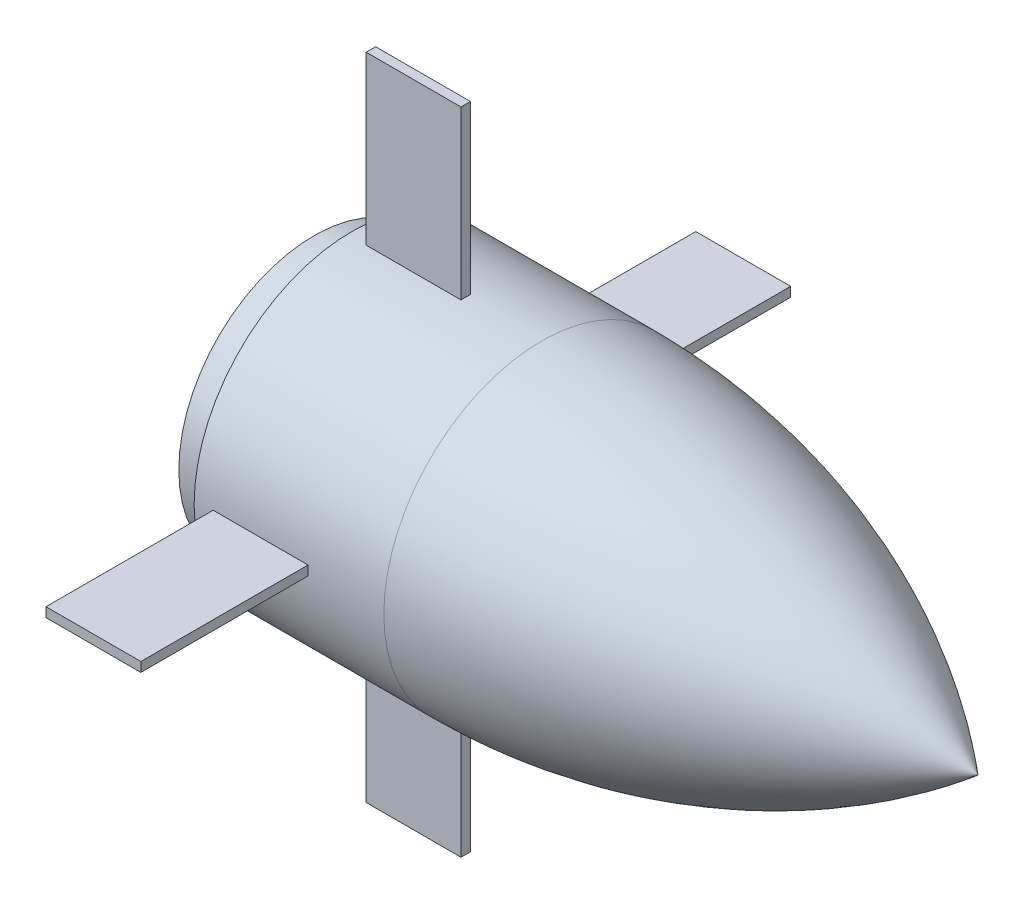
ISO-10303-21;
HEADER;
FILE_DESCRIPTION(('STEP AP214'),'2;1');
FILE_NAME('part.step','',(''),(''),'','','');
FILE_SCHEMA(('AUTOMOTIVE_DESIGN { 1 0 10303 214 1 1 1 1 }'));
ENDSEC;
DATA;
#1=APPLICATION_CONTEXT('core data for automotive mechanical design processes');
#2=APPLICATION_PROTOCOL_DEFINITION('international standard','automotive_design',2000,#1);
#3=PRODUCT_CONTEXT('',#1,'mechanical');
#4=PRODUCT('Part','Part','',(#3));
#5=PRODUCT_RELATED_PRODUCT_CATEGORY('part','',(#4));
#6=PRODUCT_DEFINITION_FORMATION('','',#4);
#7=PRODUCT_DEFINITION_CONTEXT('part definition',#1,'design');
#8=PRODUCT_DEFINITION('design','',#6,#7);
#9=PRODUCT_DEFINITION_SHAPE('','',#8);
#10=(LENGTH_UNIT() NAMED_UNIT(*) SI_UNIT(.MILLI.,.METRE.));
#11=(NAMED_UNIT(*) PLANE_ANGLE_UNIT() SI_UNIT($,.RADIAN.));
#12=(NAMED_UNIT(*) SI_UNIT($,.STERADIAN.) SOLID_ANGLE_UNIT());
#13=UNCERTAINTY_MEASURE_WITH_UNIT(LENGTH_MEASURE(1.E-05),#10,'distance_accuracy_value','');
#14=(GEOMETRIC_REPRESENTATION_CONTEXT(3) GLOBAL_UNCERTAINTY_ASSIGNED_CONTEXT((#13)) GLOBAL_UNIT_ASSIGNED_CONTEXT((#10,
#11,#12)) REPRESENTATION_CONTEXT('',''));
#15=CARTESIAN_POINT('',(0.,0.,0.));
#16=DIRECTION('',(0.,0.,1.));
#17=DIRECTION('',(1.,0.,0.));
#18=AXIS2_PLACEMENT_3D('',#15,#16,#17);
#19=CARTESIAN_POINT('',(0.,0.,0.));
#20=DIRECTION('',(1.,0.,0.));
#21=DIRECTION('',(0.,0.,-1.));
#22=AXIS2_PLACEMENT_3D('',#19,#20,#21);
#23=PLANE('',#22);
#24=CARTESIAN_POINT('',(0.,0.,0.));
#25=DIRECTION('',(-1.,0.,0.));
#26=DIRECTION('',(0.,0.,1.));
#27=AXIS2_PLACEMENT_3D('',#24,#25,#26);
#28=CIRCLE('',#27,71.25);
#29=CARTESIAN_POINT('',(0.,0.,71.25));
#30=VERTEX_POINT('',#29);
#31=EDGE_CURVE('E238',#30,#30,#28,.T.);
#32=ORIENTED_EDGE('',*,*,#31,.T.);
#33=EDGE_LOOP('',(#32));
#34=FACE_BOUND('',#33,.T.);
#35=ADVANCED_FACE('F33',(#34),#23,.F.);
#36=CARTESIAN_POINT('',(0.,0.,0.));
#37=DIRECTION('',(-1.,0.,0.));
#38=DIRECTION('',(0.,0.,1.));
#39=AXIS2_PLACEMENT_3D('',#36,#37,#38);
#40=CYLINDRICAL_SURFACE('',#39,71.25);
#41=ORIENTED_EDGE('',*,*,#31,.F.);
#42=EDGE_LOOP('',(#41));
#43=FACE_BOUND('',#42,.T.);
#44=CARTESIAN_POINT('',(20.,0.,0.));
#45=DIRECTION('',(-1.,0.,0.));
#46=DIRECTION('',(0.,0.,1.));
#47=AXIS2_PLACEMENT_3D('',#44,#45,#46);
#48=CIRCLE('',#47,71.25);
#49=CARTESIAN_POINT('',(20.,0.,71.25));
#50=VERTEX_POINT('',#49);
#51=EDGE_CURVE('E235',#50,#50,#48,.T.);
#52=ORIENTED_EDGE('',*,*,#51,.T.);
#53=EDGE_LOOP('',(#52));
#54=FACE_BOUND('',#53,.T.);
#55=ADVANCED_FACE('F315',(#43,#54),#40,.T.);
#56=CARTESIAN_POINT('',(20.,71.25,0.));
#57=DIRECTION('',(1.,0.,0.));
#58=DIRECTION('',(0.,0.,-1.));
#59=AXIS2_PLACEMENT_3D('',#56,#57,#58);
#60=PLANE('',#59);
#61=ORIENTED_EDGE('',*,*,#51,.F.);
#62=EDGE_LOOP('',(#61));
#63=FACE_BOUND('',#62,.T.);
#64=CARTESIAN_POINT('',(20.,0.,0.));
#65=DIRECTION('',(-1.,0.,0.));
#66=DIRECTION('',(0.,0.,1.));
#67=AXIS2_PLACEMENT_3D('',#64,#65,#66);
#68=CIRCLE('',#67,83.19);
#69=CARTESIAN_POINT('',(20.,0.,83.19));
#70=VERTEX_POINT('',#69);
#71=EDGE_CURVE('E232',#70,#70,#68,.T.);
#72=ORIENTED_EDGE('',*,*,#71,.T.);
#73=EDGE_LOOP('',(#72));
#74=FACE_BOUND('',#73,.T.);
#75=ADVANCED_FACE('F292',(#63,#74),#60,.F.);
#76=CARTESIAN_POINT('',(0.,0.,0.));
#77=DIRECTION('',(-1.,0.,0.));
#78=DIRECTION('',(0.,0.,1.));
#79=AXIS2_PLACEMENT_3D('',#76,#77,#78);
#80=CYLINDRICAL_SURFACE('',#79,83.19);
#81=DIRECTION('',(-1.,0.,0.));
#82=VECTOR('',#81,1.);
#83=CARTESIAN_POINT('',(0.,2.50000000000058,83.1524269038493));
#84=LINE('',#83,#82);
#85=CARTESIAN_POINT('',(80.,2.50000000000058,83.1524269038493));
#86=VERTEX_POINT('',#85);
#87=CARTESIAN_POINT('',(30.,2.50000000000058,83.1524269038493));
#88=VERTEX_POINT('',#87);
#89=EDGE_CURVE('E40',#86,#88,#84,.T.);
#90=ORIENTED_EDGE('',*,*,#89,.F.);
#91=CARTESIAN_POINT('',(80.,0.,0.));
#92=DIRECTION('',(1.,0.,0.));
#93=DIRECTION('',(0.,0.,-1.));
#94=AXIS2_PLACEMENT_3D('',#91,#92,#93);
#95=CIRCLE('',#94,83.19);
#96=CARTESIAN_POINT('',(80.,-2.49999999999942,83.1524269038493));
#97=VERTEX_POINT('',#96);
#98=EDGE_CURVE('E11',#86,#97,#95,.T.);
#99=ORIENTED_EDGE('',*,*,#98,.T.);
#100=DIRECTION('',(-1.,0.,0.));
#101=VECTOR('',#100,1.);
#102=CARTESIAN_POINT('',(0.,-2.49999999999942,83.1524269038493));
#103=LINE('',#102,#101);
#104=CARTESIAN_POINT('',(30.,-2.49999999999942,83.1524269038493));
#105=VERTEX_POINT('',#104);
#106=EDGE_CURVE('E277',#105,#97,#103,.F.);
#107=ORIENTED_EDGE('',*,*,#106,.F.);
#108=CARTESIAN_POINT('',(30.,0.,0.));
#109=DIRECTION('',(1.,0.,0.));
#110=DIRECTION('',(0.,0.,-1.));
#111=AXIS2_PLACEMENT_3D('',#108,#109,#110);
#112=CIRCLE('',#111,83.19);
#113=EDGE_CURVE('E274',#88,#105,#112,.T.);
#114=ORIENTED_EDGE('',*,*,#113,.F.);
#115=EDGE_LOOP('',(#90,#99,#107,#114));
#116=FACE_BOUND('',#115,.T.);
#117=DIRECTION('',(-1.,0.,0.));
#118=VECTOR('',#117,1.);
#119=CARTESIAN_POINT('',(0.,-83.1524269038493,2.5000000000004));
#120=LINE('',#119,#118);
#121=CARTESIAN_POINT('',(80.,-83.1524269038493,2.5000000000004));
#122=VERTEX_POINT('',#121);
#123=CARTESIAN_POINT('',(30.,-83.1524269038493,2.5000000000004));
#124=VERTEX_POINT('',#123);
#125=EDGE_CURVE('E269',#122,#124,#120,.T.);
#126=ORIENTED_EDGE('',*,*,#125,.F.);
#127=CARTESIAN_POINT('',(80.,0.,0.));
#128=DIRECTION('',(1.,0.,0.));
#129=DIRECTION('',(0.,0.,-1.));
#130=AXIS2_PLACEMENT_3D('',#127,#128,#129);
#131=CIRCLE('',#130,83.19);
#132=CARTESIAN_POINT('',(80.,-83.1524269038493,-2.4999999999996));
#133=VERTEX_POINT('',#132);
#134=EDGE_CURVE('E272',#122,#133,#131,.T.);
#135=ORIENTED_EDGE('',*,*,#134,.T.);
#136=DIRECTION('',(-1.,0.,0.));
#137=VECTOR('',#136,1.);
#138=CARTESIAN_POINT('',(0.,-83.1524269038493,-2.4999999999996));
#139=LINE('',#138,#137);
#140=CARTESIAN_POINT('',(30.,-83.1524269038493,-2.4999999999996));
#141=VERTEX_POINT('',#140);
#142=EDGE_CURVE('E266',#141,#133,#139,.F.);
#143=ORIENTED_EDGE('',*,*,#142,.F.);
#144=CARTESIAN_POINT('',(30.,0.,0.));
#145=DIRECTION('',(1.,0.,0.));
#146=DIRECTION('',(0.,0.,-1.));
#147=AXIS2_PLACEMENT_3D('',#144,#145,#146);
#148=CIRCLE('',#147,83.19);
#149=EDGE_CURVE('E263',#124,#141,#148,.T.);
#150=ORIENTED_EDGE('',*,*,#149,.F.);
#151=EDGE_LOOP('',(#126,#135,#143,#150));
#152=FACE_BOUND('',#151,.T.);
#153=DIRECTION('',(-1.,0.,0.));
#154=VECTOR('',#153,1.);
#155=CARTESIAN_POINT('',(0.,-2.5000000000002,-83.1524269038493));
#156=LINE('',#155,#154);
#157=CARTESIAN_POINT('',(80.,-2.5000000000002,-83.1524269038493));
#158=VERTEX_POINT('',#157);
#159=CARTESIAN_POINT('',(30.,-2.5000000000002,-83.1524269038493));
#160=VERTEX_POINT('',#159);
#161=EDGE_CURVE('E258',#158,#160,#156,.T.);
#162=ORIENTED_EDGE('',*,*,#161,.F.);
#163=CARTESIAN_POINT('',(80.,0.,0.));
#164=DIRECTION('',(1.,0.,0.));
#165=DIRECTION('',(0.,0.,-1.));
#166=AXIS2_PLACEMENT_3D('',#163,#164,#165);
#167=CIRCLE('',#166,83.19);
#168=CARTESIAN_POINT('',(80.,2.4999999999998,-83.1524269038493));
#169=VERTEX_POINT('',#168);
#170=EDGE_CURVE('E261',#158,#169,#167,.T.);
#171=ORIENTED_EDGE('',*,*,#170,.T.);
#172=DIRECTION('',(-1.,0.,0.));
#173=VECTOR('',#172,1.);
#174=CARTESIAN_POINT('',(0.,2.4999999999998,-83.1524269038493));
#175=LINE('',#174,#173);
#176=CARTESIAN_POINT('',(30.,2.4999999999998,-83.1524269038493));
#177=VERTEX_POINT('',#176);
#178=EDGE_CURVE('E255',#177,#169,#175,.F.);
#179=ORIENTED_EDGE('',*,*,#178,.F.);
#180=CARTESIAN_POINT('',(30.,0.,0.));
#181=DIRECTION('',(1.,0.,0.));
#182=DIRECTION('',(0.,0.,-1.));
#183=AXIS2_PLACEMENT_3D('',#180,#181,#182);
#184=CIRCLE('',#183,83.19);
#185=EDGE_CURVE('E252',#160,#177,#184,.T.);
#186=ORIENTED_EDGE('',*,*,#185,.F.);
#187=EDGE_LOOP('',(#162,#171,#179,#186));
#188=FACE_BOUND('',#187,.T.);
#189=DIRECTION('',(-1.,0.,0.));
#190=VECTOR('',#189,1.);
#191=CARTESIAN_POINT('',(0.,83.1524269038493,-2.5));
#192=LINE('',#191,#190);
#193=CARTESIAN_POINT('',(80.,83.1524269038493,-2.5));
#194=VERTEX_POINT('',#193);
#195=CARTESIAN_POINT('',(30.,83.1524269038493,-2.5));
#196=VERTEX_POINT('',#195);
#197=EDGE_CURVE('E247',#194,#196,#192,.T.);
#198=ORIENTED_EDGE('',*,*,#197,.F.);
#199=CARTESIAN_POINT('',(80.,0.,0.));
#200=DIRECTION('',(1.,0.,0.));
#201=DIRECTION('',(0.,0.,-1.));
#202=AXIS2_PLACEMENT_3D('',#199,#200,#201);
#203=CIRCLE('',#202,83.19);
#204=CARTESIAN_POINT('',(80.,83.1524269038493,2.5));
#205=VERTEX_POINT('',#204);
#206=EDGE_CURVE('E250',#194,#205,#203,.T.);
#207=ORIENTED_EDGE('',*,*,#206,.T.);
#208=DIRECTION('',(-1.,0.,0.));
#209=VECTOR('',#208,1.);
#210=CARTESIAN_POINT('',(0.,83.1524269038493,2.5));
#211=LINE('',#210,#209);
#212=CARTESIAN_POINT('',(30.,83.1524269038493,2.5));
#213=VERTEX_POINT('',#212);
#214=EDGE_CURVE('E244',#213,#205,#211,.F.);
#215=ORIENTED_EDGE('',*,*,#214,.F.);
#216=CARTESIAN_POINT('',(30.,0.,0.));
#217=DIRECTION('',(1.,0.,0.));
#218=DIRECTION('',(0.,0.,-1.));
#219=AXIS2_PLACEMENT_3D('',#216,#217,#218);
#220=CIRCLE('',#219,83.19);
#221=EDGE_CURVE('E241',#196,#213,#220,.T.);
#222=ORIENTED_EDGE('',*,*,#221,.F.);
#223=EDGE_LOOP('',(#198,#207,#215,#222));
#224=FACE_BOUND('',#223,.T.);
#225=ORIENTED_EDGE('',*,*,#71,.F.);
#226=EDGE_LOOP('',(#225));
#227=FACE_BOUND('',#226,.T.);
#228=CARTESIAN_POINT('',(120.,0.,0.));
#229=DIRECTION('',(-1.,0.,0.));
#230=DIRECTION('',(0.,0.,1.));
#231=AXIS2_PLACEMENT_3D('',#228,#229,#230);
#232=CIRCLE('',#231,83.19);
#233=CARTESIAN_POINT('',(120.,0.,83.19));
#234=VERTEX_POINT('',#233);
#235=EDGE_CURVE('E229',#234,#234,#232,.T.);
#236=ORIENTED_EDGE('',*,*,#235,.T.);
#237=EDGE_LOOP('',(#236));
#238=FACE_BOUND('',#237,.T.);
#239=ADVANCED_FACE('F288',(#116,#152,#188,#224,#227,#238),#80,.T.);
#240=CARTESIAN_POINT('',(120.,0.,-276.351868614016));
#241=DIRECTION('',(0.,-1.,0.));
#242=DIRECTION('',(0.,0.,1.));
#243=AXIS2_PLACEMENT_3D('',#240,#241,#242);
#244=CIRCLE('',#243,359.541868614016);
#245=TRIMMED_CURVE('',#244,(PARAMETER_VALUE(-0.694111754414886)),
(PARAMETER_VALUE(0.694111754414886)),.T.,.PARAMETER.);
#246=CARTESIAN_POINT('',(120.,0.,0.));
#247=DIRECTION('',(-1.,0.,0.));
#248=AXIS1_PLACEMENT('',#246,#247);
#249=SURFACE_OF_REVOLUTION('',#245,#248);
#250=ORIENTED_EDGE('',*,*,#235,.F.);
#251=EDGE_LOOP('',(#250));
#252=FACE_BOUND('',#251,.T.);
#253=CARTESIAN_POINT('',(350.,0.,0.));
#254=VERTEX_POINT('',#253);
#255=VERTEX_LOOP('',#254);
#256=FACE_BOUND('',#255,.T.);
#257=ADVANCED_FACE('F291',(#252,#256),#249,.T.);
#258=CARTESIAN_POINT('',(80.,71.25,-2.5));
#259=DIRECTION('',(0.,0.,1.));
#260=DIRECTION('',(1.,0.,0.));
#261=AXIS2_PLACEMENT_3D('',#258,#259,#260);
#262=PLANE('',#261);
#263=DIRECTION('',(0.,1.,0.));
#264=VECTOR('',#263,1.);
#265=CARTESIAN_POINT('',(80.,71.25,-2.5));
#266=LINE('',#265,#264);
#267=CARTESIAN_POINT('',(80.,171.25,-2.5));
#268=VERTEX_POINT('',#267);
#269=EDGE_CURVE('E210',#194,#268,#266,.T.);
#270=ORIENTED_EDGE('',*,*,#269,.F.);
#271=ORIENTED_EDGE('',*,*,#197,.T.);
#272=DIRECTION('',(0.,1.,0.));
#273=VECTOR('',#272,1.);
#274=CARTESIAN_POINT('',(30.,71.25,-2.5));
#275=LINE('',#274,#273);
#276=CARTESIAN_POINT('',(30.,171.25,-2.5));
#277=VERTEX_POINT('',#276);
#278=EDGE_CURVE('E209',#196,#277,#275,.T.);
#279=ORIENTED_EDGE('',*,*,#278,.T.);
#280=DIRECTION('',(-1.,0.,0.));
#281=VECTOR('',#280,1.);
#282=CARTESIAN_POINT('',(80.,171.25,-2.5));
#283=LINE('',#282,#281);
#284=EDGE_CURVE('E226',#268,#277,#283,.T.);
#285=ORIENTED_EDGE('',*,*,#284,.F.);
#286=EDGE_LOOP('',(#270,#271,#279,#285));
#287=FACE_BOUND('',#286,.T.);
#288=ADVANCED_FACE('F306',(#287),#262,.F.);
#289=CARTESIAN_POINT('',(80.,71.25,2.5));
#290=DIRECTION('',(0.,0.,-1.));
#291=DIRECTION('',(-1.,0.,0.));
#292=AXIS2_PLACEMENT_3D('',#289,#290,#291);
#293=PLANE('',#292);
#294=DIRECTION('',(0.,-1.,0.));
#295=VECTOR('',#294,1.);
#296=CARTESIAN_POINT('',(30.,71.25,2.5));
#297=LINE('',#296,#295);
#298=CARTESIAN_POINT('',(30.,171.25,2.5));
#299=VERTEX_POINT('',#298);
#300=EDGE_CURVE('E213',#299,#213,#297,.T.);
#301=ORIENTED_EDGE('',*,*,#300,.T.);
#302=ORIENTED_EDGE('',*,*,#214,.T.);
#303=DIRECTION('',(0.,-1.,0.));
#304=VECTOR('',#303,1.);
#305=CARTESIAN_POINT('',(80.,71.25,2.5));
#306=LINE('',#305,#304);
#307=CARTESIAN_POINT('',(80.,171.25,2.5));
#308=VERTEX_POINT('',#307);
#309=EDGE_CURVE('E215',#308,#205,#306,.T.);
#310=ORIENTED_EDGE('',*,*,#309,.F.);
#311=DIRECTION('',(-1.,0.,0.));
#312=VECTOR('',#311,1.);
#313=CARTESIAN_POINT('',(80.,171.25,2.5));
#314=LINE('',#313,#312);
#315=EDGE_CURVE('E218',#308,#299,#314,.T.);
#316=ORIENTED_EDGE('',*,*,#315,.T.);
#317=EDGE_LOOP('',(#301,#302,#310,#316));
#318=FACE_BOUND('',#317,.T.);
#319=ADVANCED_FACE('F311',(#318),#293,.F.);
#320=CARTESIAN_POINT('',(80.,171.25,-2.5));
#321=DIRECTION('',(0.,-1.,0.));
#322=DIRECTION('',(0.,0.,-1.));
#323=AXIS2_PLACEMENT_3D('',#320,#321,#322);
#324=PLANE('',#323);
#325=DIRECTION('',(0.,0.,1.));
#326=VECTOR('',#325,1.);
#327=CARTESIAN_POINT('',(30.,171.25,-2.5));
#328=LINE('',#327,#326);
#329=EDGE_CURVE('E220',#277,#299,#328,.T.);
#330=ORIENTED_EDGE('',*,*,#329,.T.);
#331=ORIENTED_EDGE('',*,*,#315,.F.);
#332=DIRECTION('',(0.,0.,1.));
#333=VECTOR('',#332,1.);
#334=CARTESIAN_POINT('',(80.,171.25,-2.5));
#335=LINE('',#334,#333);
#336=EDGE_CURVE('E212',#268,#308,#335,.T.);
#337=ORIENTED_EDGE('',*,*,#336,.F.);
#338=ORIENTED_EDGE('',*,*,#284,.T.);
#339=EDGE_LOOP('',(#330,#331,#337,#338));
#340=FACE_BOUND('',#339,.T.);
#341=ADVANCED_FACE('F491',(#340),#324,.F.);
#342=CARTESIAN_POINT('',(80.,0.,0.));
#343=DIRECTION('',(1.,0.,0.));
#344=DIRECTION('',(0.,0.,-1.));
#345=AXIS2_PLACEMENT_3D('',#342,#343,#344);
#346=PLANE('',#345);
#347=ORIENTED_EDGE('',*,*,#206,.F.);
#348=ORIENTED_EDGE('',*,*,#269,.T.);
#349=ORIENTED_EDGE('',*,*,#336,.T.);
#350=ORIENTED_EDGE('',*,*,#309,.T.);
#351=EDGE_LOOP('',(#347,#348,#349,#350));
#352=FACE_BOUND('',#351,.T.);
#353=ADVANCED_FACE('F488',(#352),#346,.T.);
#354=CARTESIAN_POINT('',(30.,0.,0.));
#355=DIRECTION('',(1.,0.,0.));
#356=DIRECTION('',(0.,0.,-1.));
#357=AXIS2_PLACEMENT_3D('',#354,#355,#356);
#358=PLANE('',#357);
#359=ORIENTED_EDGE('',*,*,#278,.F.);
#360=ORIENTED_EDGE('',*,*,#221,.T.);
#361=ORIENTED_EDGE('',*,*,#300,.F.);
#362=ORIENTED_EDGE('',*,*,#329,.F.);
#363=EDGE_LOOP('',(#359,#360,#361,#362));
#364=FACE_BOUND('',#363,.T.);
#365=ADVANCED_FACE('F343',(#364),#358,.F.);
#366=CARTESIAN_POINT('',(80.,-2.50000000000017,-71.25));
#367=DIRECTION('',(0.,1.,0.));
#368=DIRECTION('',(0.,0.,1.));
#369=AXIS2_PLACEMENT_3D('',#366,#367,#368);
#370=PLANE('',#369);
#371=DIRECTION('',(0.,0.,-1.));
#372=VECTOR('',#371,1.);
#373=CARTESIAN_POINT('',(80.,-2.50000000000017,-71.25));
#374=LINE('',#373,#372);
#375=CARTESIAN_POINT('',(80.,-2.50000000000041,-171.25));
#376=VERTEX_POINT('',#375);
#377=EDGE_CURVE('E190',#158,#376,#374,.T.);
#378=ORIENTED_EDGE('',*,*,#377,.F.);
#379=ORIENTED_EDGE('',*,*,#161,.T.);
#380=DIRECTION('',(0.,0.,-1.));
#381=VECTOR('',#380,1.);
#382=CARTESIAN_POINT('',(30.,-2.50000000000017,-71.25));
#383=LINE('',#382,#381);
#384=CARTESIAN_POINT('',(30.,-2.50000000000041,-171.25));
#385=VERTEX_POINT('',#384);
#386=EDGE_CURVE('E189',#160,#385,#383,.T.);
#387=ORIENTED_EDGE('',*,*,#386,.T.);
#388=DIRECTION('',(-1.,0.,0.));
#389=VECTOR('',#388,1.);
#390=CARTESIAN_POINT('',(80.,-2.50000000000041,-171.25));
#391=LINE('',#390,#389);
#392=EDGE_CURVE('E206',#376,#385,#391,.T.);
#393=ORIENTED_EDGE('',*,*,#392,.F.);
#394=EDGE_LOOP('',(#378,#379,#387,#393));
#395=FACE_BOUND('',#394,.T.);
#396=ADVANCED_FACE('F348',(#395),#370,.F.);
#397=CARTESIAN_POINT('',(80.,2.49999999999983,-71.25));
#398=DIRECTION('',(0.,-1.,0.));
#399=DIRECTION('',(0.,0.,-1.));
#400=AXIS2_PLACEMENT_3D('',#397,#398,#399);
#401=PLANE('',#400);
#402=DIRECTION('',(0.,0.,1.));
#403=VECTOR('',#402,1.);
#404=CARTESIAN_POINT('',(30.,2.49999999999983,-71.25));
#405=LINE('',#404,#403);
#406=CARTESIAN_POINT('',(30.,2.49999999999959,-171.25));
#407=VERTEX_POINT('',#406);
#408=EDGE_CURVE('E193',#407,#177,#405,.T.);
#409=ORIENTED_EDGE('',*,*,#408,.T.);
#410=ORIENTED_EDGE('',*,*,#178,.T.);
#411=DIRECTION('',(0.,0.,1.));
#412=VECTOR('',#411,1.);
#413=CARTESIAN_POINT('',(80.,2.49999999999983,-71.25));
#414=LINE('',#413,#412);
#415=CARTESIAN_POINT('',(80.,2.49999999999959,-171.25));
#416=VERTEX_POINT('',#415);
#417=EDGE_CURVE('E195',#416,#169,#414,.T.);
#418=ORIENTED_EDGE('',*,*,#417,.F.);
#419=DIRECTION('',(-1.,0.,0.));
#420=VECTOR('',#419,1.);
#421=CARTESIAN_POINT('',(80.,2.49999999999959,-171.25));
#422=LINE('',#421,#420);
#423=EDGE_CURVE('E198',#416,#407,#422,.T.);
#424=ORIENTED_EDGE('',*,*,#423,.T.);
#425=EDGE_LOOP('',(#409,#410,#418,#424));
#426=FACE_BOUND('',#425,.T.);
#427=ADVANCED_FACE('F353',(#426),#401,.F.);
#428=CARTESIAN_POINT('',(80.,-2.50000000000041,-171.25));
#429=DIRECTION('',(0.,0.,1.));
#430=DIRECTION('',(0.,-1.,0.));
#431=AXIS2_PLACEMENT_3D('',#428,#429,#430);
#432=PLANE('',#431);
#433=DIRECTION('',(0.,1.,0.));
#434=VECTOR('',#433,1.);
#435=CARTESIAN_POINT('',(30.,-2.50000000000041,-171.25));
#436=LINE('',#435,#434);
#437=EDGE_CURVE('E200',#385,#407,#436,.T.);
#438=ORIENTED_EDGE('',*,*,#437,.T.);
#439=ORIENTED_EDGE('',*,*,#423,.F.);
#440=DIRECTION('',(0.,1.,0.));
#441=VECTOR('',#440,1.);
#442=CARTESIAN_POINT('',(80.,-2.50000000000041,-171.25));
#443=LINE('',#442,#441);
#444=EDGE_CURVE('E192',#376,#416,#443,.T.);
#445=ORIENTED_EDGE('',*,*,#444,.F.);
#446=ORIENTED_EDGE('',*,*,#392,.T.);
#447=EDGE_LOOP('',(#438,#439,#445,#446));
#448=FACE_BOUND('',#447,.T.);
#449=ADVANCED_FACE('F363',(#448),#432,.F.);
#450=CARTESIAN_POINT('',(80.,0.,0.));
#451=DIRECTION('',(1.,0.,0.));
#452=DIRECTION('',(0.,-1.,0.));
#453=AXIS2_PLACEMENT_3D('',#450,#451,#452);
#454=PLANE('',#453);
#455=ORIENTED_EDGE('',*,*,#170,.F.);
#456=ORIENTED_EDGE('',*,*,#377,.T.);
#457=ORIENTED_EDGE('',*,*,#444,.T.);
#458=ORIENTED_EDGE('',*,*,#417,.T.);
#459=EDGE_LOOP('',(#455,#456,#457,#458));
#460=FACE_BOUND('',#459,.T.);
#461=ADVANCED_FACE('F373',(#460),#454,.T.);
#462=CARTESIAN_POINT('',(30.,0.,0.));
#463=DIRECTION('',(1.,0.,0.));
#464=DIRECTION('',(0.,-1.,0.));
#465=AXIS2_PLACEMENT_3D('',#462,#463,#464);
#466=PLANE('',#465);
#467=ORIENTED_EDGE('',*,*,#386,.F.);
#468=ORIENTED_EDGE('',*,*,#185,.T.);
#469=ORIENTED_EDGE('',*,*,#408,.F.);
#470=ORIENTED_EDGE('',*,*,#437,.F.);
#471=EDGE_LOOP('',(#467,#468,#469,#470));
#472=FACE_BOUND('',#471,.T.);
#473=ADVANCED_FACE('F383',(#472),#466,.F.);
#474=CARTESIAN_POINT('',(80.,-71.25,2.50000000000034));
#475=DIRECTION('',(0.,0.,-1.));
#476=DIRECTION('',(0.,1.,0.));
#477=AXIS2_PLACEMENT_3D('',#474,#475,#476);
#478=PLANE('',#477);
#479=DIRECTION('',(0.,-1.,0.));
#480=VECTOR('',#479,1.);
#481=CARTESIAN_POINT('',(80.,-71.25,2.50000000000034));
#482=LINE('',#481,#480);
#483=CARTESIAN_POINT('',(80.,-171.25,2.50000000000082));
#484=VERTEX_POINT('',#483);
#485=EDGE_CURVE('E172',#122,#484,#482,.T.);
#486=ORIENTED_EDGE('',*,*,#485,.F.);
#487=ORIENTED_EDGE('',*,*,#125,.T.);
#488=DIRECTION('',(0.,-1.,0.));
#489=VECTOR('',#488,1.);
#490=CARTESIAN_POINT('',(30.,-71.25,2.50000000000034));
#491=LINE('',#490,#489);
#492=CARTESIAN_POINT('',(30.,-171.25,2.50000000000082));
#493=VERTEX_POINT('',#492);
#494=EDGE_CURVE('E165',#124,#493,#491,.T.);
#495=ORIENTED_EDGE('',*,*,#494,.T.);
#496=DIRECTION('',(-1.,0.,0.));
#497=VECTOR('',#496,1.);
#498=CARTESIAN_POINT('',(80.,-171.25,2.50000000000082));
#499=LINE('',#498,#497);
#500=EDGE_CURVE('E186',#484,#493,#499,.T.);
#501=ORIENTED_EDGE('',*,*,#500,.F.);
#502=EDGE_LOOP('',(#486,#487,#495,#501));
#503=FACE_BOUND('',#502,.T.);
#504=ADVANCED_FACE('F393',(#503),#478,.F.);
#505=CARTESIAN_POINT('',(80.,-71.25,-2.49999999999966));
#506=DIRECTION('',(0.,0.,1.));
#507=DIRECTION('',(0.,-1.,0.));
#508=AXIS2_PLACEMENT_3D('',#505,#506,#507);
#509=PLANE('',#508);
#510=DIRECTION('',(0.,1.,0.));
#511=VECTOR('',#510,1.);
#512=CARTESIAN_POINT('',(30.,-71.25,-2.49999999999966));
#513=LINE('',#512,#511);
#514=CARTESIAN_POINT('',(30.,-171.25,-2.49999999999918));
#515=VERTEX_POINT('',#514);
#516=EDGE_CURVE('E175',#515,#141,#513,.T.);
#517=ORIENTED_EDGE('',*,*,#516,.T.);
#518=ORIENTED_EDGE('',*,*,#142,.T.);
#519=DIRECTION('',(0.,1.,0.));
#520=VECTOR('',#519,1.);
#521=CARTESIAN_POINT('',(80.,-71.25,-2.49999999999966));
#522=LINE('',#521,#520);
#523=CARTESIAN_POINT('',(80.,-171.25,-2.49999999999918));
#524=VERTEX_POINT('',#523);
#525=EDGE_CURVE('E177',#524,#133,#522,.T.);
#526=ORIENTED_EDGE('',*,*,#525,.F.);
#527=DIRECTION('',(-1.,0.,0.));
#528=VECTOR('',#527,1.);
#529=CARTESIAN_POINT('',(80.,-171.25,-2.49999999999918));
#530=LINE('',#529,#528);
#531=EDGE_CURVE('E179',#524,#515,#530,.T.);
#532=ORIENTED_EDGE('',*,*,#531,.T.);
#533=EDGE_LOOP('',(#517,#518,#526,#532));
#534=FACE_BOUND('',#533,.T.);
#535=ADVANCED_FACE('F403',(#534),#509,.F.);
#536=CARTESIAN_POINT('',(80.,-171.25,2.50000000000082));
#537=DIRECTION('',(0.,1.,0.));
#538=DIRECTION('',(0.,0.,1.));
#539=AXIS2_PLACEMENT_3D('',#536,#537,#538);
#540=PLANE('',#539);
#541=DIRECTION('',(0.,0.,-1.));
#542=VECTOR('',#541,1.);
#543=CARTESIAN_POINT('',(30.,-171.25,2.50000000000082));
#544=LINE('',#543,#542);
#545=EDGE_CURVE('E167',#493,#515,#544,.T.);
#546=ORIENTED_EDGE('',*,*,#545,.T.);
#547=ORIENTED_EDGE('',*,*,#531,.F.);
#548=DIRECTION('',(0.,0.,-1.));
#549=VECTOR('',#548,1.);
#550=CARTESIAN_POINT('',(80.,-171.25,2.50000000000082));
#551=LINE('',#550,#549);
#552=EDGE_CURVE('E174',#484,#524,#551,.T.);
#553=ORIENTED_EDGE('',*,*,#552,.F.);
#554=ORIENTED_EDGE('',*,*,#500,.T.);
#555=EDGE_LOOP('',(#546,#547,#553,#554));
#556=FACE_BOUND('',#555,.T.);
#557=ADVANCED_FACE('F413',(#556),#540,.F.);
#558=CARTESIAN_POINT('',(80.,0.,0.));
#559=DIRECTION('',(1.,0.,0.));
#560=DIRECTION('',(0.,0.,1.));
#561=AXIS2_PLACEMENT_3D('',#558,#559,#560);
#562=PLANE('',#561);
#563=ORIENTED_EDGE('',*,*,#134,.F.);
#564=ORIENTED_EDGE('',*,*,#485,.T.);
#565=ORIENTED_EDGE('',*,*,#552,.T.);
#566=ORIENTED_EDGE('',*,*,#525,.T.);
#567=EDGE_LOOP('',(#563,#564,#565,#566));
#568=FACE_BOUND('',#567,.T.);
#569=ADVANCED_FACE('F423',(#568),#562,.T.);
#570=CARTESIAN_POINT('',(30.,0.,0.));
#571=DIRECTION('',(1.,0.,0.));
#572=DIRECTION('',(0.,0.,1.));
#573=AXIS2_PLACEMENT_3D('',#570,#571,#572);
#574=PLANE('',#573);
#575=ORIENTED_EDGE('',*,*,#494,.F.);
#576=ORIENTED_EDGE('',*,*,#149,.T.);
#577=ORIENTED_EDGE('',*,*,#516,.F.);
#578=ORIENTED_EDGE('',*,*,#545,.F.);
#579=EDGE_LOOP('',(#575,#576,#577,#578));
#580=FACE_BOUND('',#579,.T.);
#581=ADVANCED_FACE('F433',(#580),#574,.F.);
#582=CARTESIAN_POINT('',(80.,2.50000000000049,71.25));
#583=DIRECTION('',(0.,-1.,0.));
#584=DIRECTION('',(0.,0.,-1.));
#585=AXIS2_PLACEMENT_3D('',#582,#583,#584);
#586=PLANE('',#585);
#587=DIRECTION('',(0.,0.,1.));
#588=VECTOR('',#587,1.);
#589=CARTESIAN_POINT('',(80.,2.50000000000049,71.25));
#590=LINE('',#589,#588);
#591=CARTESIAN_POINT('',(80.,2.50000000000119,171.25));
#592=VERTEX_POINT('',#591);
#593=EDGE_CURVE('E142',#86,#592,#590,.T.);
#594=ORIENTED_EDGE('',*,*,#593,.F.);
#595=ORIENTED_EDGE('',*,*,#89,.T.);
#596=DIRECTION('',(0.,0.,1.));
#597=VECTOR('',#596,1.);
#598=CARTESIAN_POINT('',(30.,2.50000000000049,71.25));
#599=LINE('',#598,#597);
#600=CARTESIAN_POINT('',(30.,2.50000000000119,171.25));
#601=VERTEX_POINT('',#600);
#602=EDGE_CURVE('E163',#88,#601,#599,.T.);
#603=ORIENTED_EDGE('',*,*,#602,.T.);
#604=DIRECTION('',(-1.,0.,0.));
#605=VECTOR('',#604,1.);
#606=CARTESIAN_POINT('',(80.,2.50000000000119,171.25));
#607=LINE('',#606,#605);
#608=EDGE_CURVE('E155',#592,#601,#607,.T.);
#609=ORIENTED_EDGE('',*,*,#608,.F.);
#610=EDGE_LOOP('',(#594,#595,#603,#609));
#611=FACE_BOUND('',#610,.T.);
#612=ADVANCED_FACE('F161',(#611),#586,.F.);
#613=CARTESIAN_POINT('',(80.,-2.49999999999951,71.25));
#614=DIRECTION('',(0.,1.,0.));
#615=DIRECTION('',(0.,0.,1.));
#616=AXIS2_PLACEMENT_3D('',#613,#614,#615);
#617=PLANE('',#616);
#618=DIRECTION('',(0.,0.,-1.));
#619=VECTOR('',#618,1.);
#620=CARTESIAN_POINT('',(30.,-2.49999999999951,71.25));
#621=LINE('',#620,#619);
#622=CARTESIAN_POINT('',(30.,-2.49999999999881,171.25));
#623=VERTEX_POINT('',#622);
#624=EDGE_CURVE('E150',#623,#105,#621,.T.);
#625=ORIENTED_EDGE('',*,*,#624,.T.);
#626=ORIENTED_EDGE('',*,*,#106,.T.);
#627=DIRECTION('',(0.,0.,-1.));
#628=VECTOR('',#627,1.);
#629=CARTESIAN_POINT('',(80.,-2.49999999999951,71.25));
#630=LINE('',#629,#628);
#631=CARTESIAN_POINT('',(80.,-2.49999999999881,171.25));
#632=VERTEX_POINT('',#631);
#633=EDGE_CURVE('E159',#632,#97,#630,.T.);
#634=ORIENTED_EDGE('',*,*,#633,.F.);
#635=DIRECTION('',(-1.,0.,0.));
#636=VECTOR('',#635,1.);
#637=CARTESIAN_POINT('',(80.,-2.49999999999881,171.25));
#638=LINE('',#637,#636);
#639=EDGE_CURVE('E157',#632,#623,#638,.T.);
#640=ORIENTED_EDGE('',*,*,#639,.T.);
#641=EDGE_LOOP('',(#625,#626,#634,#640));
#642=FACE_BOUND('',#641,.T.);
#643=ADVANCED_FACE('F287',(#642),#617,.F.);
#644=CARTESIAN_POINT('',(80.,2.50000000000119,171.25));
#645=DIRECTION('',(0.,0.,-1.));
#646=DIRECTION('',(0.,1.,0.));
#647=AXIS2_PLACEMENT_3D('',#644,#645,#646);
#648=PLANE('',#647);
#649=DIRECTION('',(0.,-1.,0.));
#650=VECTOR('',#649,1.);
#651=CARTESIAN_POINT('',(30.,2.50000000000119,171.25));
#652=LINE('',#651,#650);
#653=EDGE_CURVE('E282',#601,#623,#652,.T.);
#654=ORIENTED_EDGE('',*,*,#653,.T.);
#655=ORIENTED_EDGE('',*,*,#639,.F.);
#656=DIRECTION('',(0.,-1.,0.));
#657=VECTOR('',#656,1.);
#658=CARTESIAN_POINT('',(80.,2.50000000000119,171.25));
#659=LINE('',#658,#657);
#660=EDGE_CURVE('E146',#592,#632,#659,.T.);
#661=ORIENTED_EDGE('',*,*,#660,.F.);
#662=ORIENTED_EDGE('',*,*,#608,.T.);
#663=EDGE_LOOP('',(#654,#655,#661,#662));
#664=FACE_BOUND('',#663,.T.);
#665=ADVANCED_FACE('F154',(#664),#648,.F.);
#666=CARTESIAN_POINT('',(80.,0.,0.));
#667=DIRECTION('',(1.,0.,0.));
#668=DIRECTION('',(0.,1.,0.));
#669=AXIS2_PLACEMENT_3D('',#666,#667,#668);
#670=PLANE('',#669);
#671=ORIENTED_EDGE('',*,*,#98,.F.);
#672=ORIENTED_EDGE('',*,*,#593,.T.);
#673=ORIENTED_EDGE('',*,*,#660,.T.);
#674=ORIENTED_EDGE('',*,*,#633,.T.);
#675=EDGE_LOOP('',(#671,#672,#673,#674));
#676=FACE_BOUND('',#675,.T.);
#677=ADVANCED_FACE('F144',(#676),#670,.T.);
#678=CARTESIAN_POINT('',(30.,0.,0.));
#679=DIRECTION('',(1.,0.,0.));
#680=DIRECTION('',(0.,1.,0.));
#681=AXIS2_PLACEMENT_3D('',#678,#679,#680);
#682=PLANE('',#681);
#683=ORIENTED_EDGE('',*,*,#602,.F.);
#684=ORIENTED_EDGE('',*,*,#113,.T.);
#685=ORIENTED_EDGE('',*,*,#624,.F.);
#686=ORIENTED_EDGE('',*,*,#653,.F.);
#687=EDGE_LOOP('',(#683,#684,#685,#686));
#688=FACE_BOUND('',#687,.T.);
#689=ADVANCED_FACE('F279',(#688),#682,.F.);
#690=CLOSED_SHELL('',(#35,#55,#75,#239,#257,#288,#319,#341,#353,#365,#396,#427,#449,#461,#473,
#504,#535,#557,#569,#581,#612,#643,#665,#677,#689));
#691=MANIFOLD_SOLID_BREP('B2',#690);
#692=ADVANCED_BREP_SHAPE_REPRESENTATION('',(#18,#691),#14);
#693=SHAPE_DEFINITION_REPRESENTATION(#9,#692);
ENDSEC;
END-ISO-10303-21;
